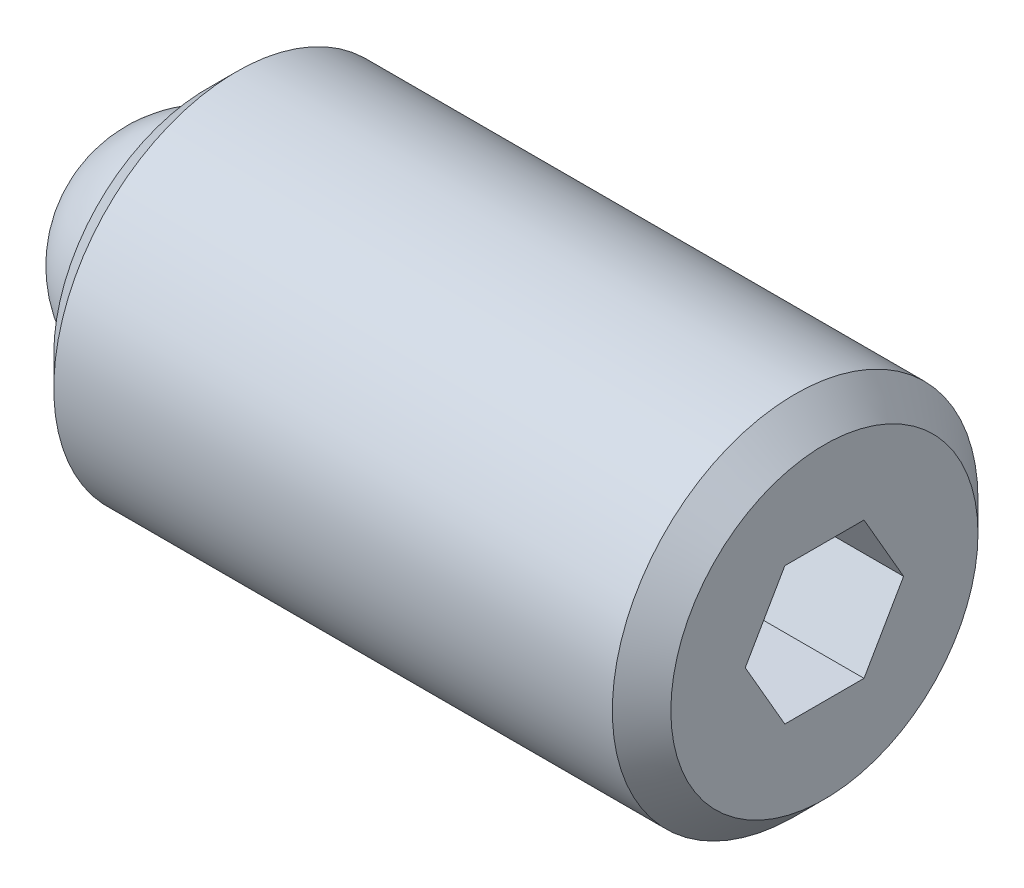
ISO-10303-21;
HEADER;
FILE_DESCRIPTION(('STEP AP214'),'2;1');
FILE_NAME('part.step','',(''),(''),'','','');
FILE_SCHEMA(('AUTOMOTIVE_DESIGN { 1 0 10303 214 1 1 1 1 }'));
ENDSEC;
DATA;
#1=APPLICATION_CONTEXT('core data for automotive mechanical design processes');
#2=APPLICATION_PROTOCOL_DEFINITION('international standard','automotive_design',2000,#1);
#3=PRODUCT_CONTEXT('',#1,'mechanical');
#4=PRODUCT('Part','Part','',(#3));
#5=PRODUCT_RELATED_PRODUCT_CATEGORY('part','',(#4));
#6=PRODUCT_DEFINITION_FORMATION('','',#4);
#7=PRODUCT_DEFINITION_CONTEXT('part definition',#1,'design');
#8=PRODUCT_DEFINITION('design','',#6,#7);
#9=PRODUCT_DEFINITION_SHAPE('','',#8);
#10=(LENGTH_UNIT() NAMED_UNIT(*) SI_UNIT(.MILLI.,.METRE.));
#11=(NAMED_UNIT(*) PLANE_ANGLE_UNIT() SI_UNIT($,.RADIAN.));
#12=(NAMED_UNIT(*) SI_UNIT($,.STERADIAN.) SOLID_ANGLE_UNIT());
#13=UNCERTAINTY_MEASURE_WITH_UNIT(LENGTH_MEASURE(1.E-05),#10,'distance_accuracy_value','');
#14=(GEOMETRIC_REPRESENTATION_CONTEXT(3) GLOBAL_UNCERTAINTY_ASSIGNED_CONTEXT((#13)) GLOBAL_UNIT_ASSIGNED_CONTEXT((#10,
#11,#12)) REPRESENTATION_CONTEXT('',''));
#15=CARTESIAN_POINT('',(0.,0.,0.));
#16=DIRECTION('',(0.,0.,1.));
#17=DIRECTION('',(1.,0.,0.));
#18=AXIS2_PLACEMENT_3D('',#15,#16,#17);
#19=CARTESIAN_POINT('',(0.,0.,0.));
#20=DIRECTION('',(0.,-1.,0.));
#21=DIRECTION('',(0.,0.,1.));
#22=AXIS2_PLACEMENT_3D('',#19,#20,#21);
#23=SPHERICAL_SURFACE('',#22,1.984375);
#24=CARTESIAN_POINT('',(0.,-1.984375,0.));
#25=VERTEX_POINT('',#24);
#26=VERTEX_LOOP('',#25);
#27=FACE_BOUND('',#26,.T.);
#28=ADVANCED_FACE('F43',(#27),#23,.T.);
#29=CLOSED_SHELL('',(#28));
#30=MANIFOLD_SOLID_BREP('B2',#29);
#31=CARTESIAN_POINT('',(10.715625,0.,0.));
#32=DIRECTION('',(-1.,0.,0.));
#33=DIRECTION('',(0.,0.,1.));
#34=AXIS2_PLACEMENT_3D('',#31,#32,#33);
#35=CYLINDRICAL_SURFACE('',#34,3.175);
#36=CARTESIAN_POINT('',(10.207625,0.,0.));
#37=DIRECTION('',(1.,0.,0.));
#38=DIRECTION('',(0.,0.,-1.));
#39=AXIS2_PLACEMENT_3D('',#36,#37,#38);
#40=CIRCLE('',#39,3.175);
#41=CARTESIAN_POINT('',(10.207625,0.,-3.175));
#42=VERTEX_POINT('',#41);
#43=EDGE_CURVE('E41',#42,#42,#40,.F.);
#44=ORIENTED_EDGE('',*,*,#43,.T.);
#45=EDGE_LOOP('',(#44));
#46=FACE_BOUND('',#45,.T.);
#47=CARTESIAN_POINT('',(0.507999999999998,0.,0.));
#48=DIRECTION('',(1.,0.,0.));
#49=DIRECTION('',(0.,0.,-1.));
#50=AXIS2_PLACEMENT_3D('',#47,#48,#49);
#51=CIRCLE('',#50,3.175);
#52=CARTESIAN_POINT('',(0.507999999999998,0.,-3.175));
#53=VERTEX_POINT('',#52);
#54=EDGE_CURVE('E159',#53,#53,#51,.T.);
#55=ORIENTED_EDGE('',*,*,#54,.T.);
#56=EDGE_LOOP('',(#55));
#57=FACE_BOUND('',#56,.T.);
#58=ADVANCED_FACE('F56',(#46,#57),#35,.T.);
#59=CARTESIAN_POINT('',(10.715625,0.,0.));
#60=DIRECTION('',(1.,0.,0.));
#61=DIRECTION('',(0.,0.,-1.));
#62=AXIS2_PLACEMENT_3D('',#59,#60,#61);
#63=PLANE('',#62);
#64=DIRECTION('',(0.,0.866025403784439,-0.5));
#65=VECTOR('',#64,1.);
#66=CARTESIAN_POINT('',(10.715625,-1.190625,-0.687407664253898));
#67=LINE('',#66,#65);
#68=CARTESIAN_POINT('',(10.715625,-1.190625,-0.687407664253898));
#69=VERTEX_POINT('',#68);
#70=CARTESIAN_POINT('',(10.715625,0.,-1.3748153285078));
#71=VERTEX_POINT('',#70);
#72=EDGE_CURVE('E71',#69,#71,#67,.T.);
#73=ORIENTED_EDGE('',*,*,#72,.F.);
#74=DIRECTION('',(0.,0.,-1.));
#75=VECTOR('',#74,1.);
#76=CARTESIAN_POINT('',(10.715625,-1.190625,0.687407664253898));
#77=LINE('',#76,#75);
#78=CARTESIAN_POINT('',(10.715625,-1.190625,0.687407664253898));
#79=VERTEX_POINT('',#78);
#80=EDGE_CURVE('E155',#79,#69,#77,.T.);
#81=ORIENTED_EDGE('',*,*,#80,.F.);
#82=DIRECTION('',(0.,-0.866025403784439,-0.5));
#83=VECTOR('',#82,1.);
#84=CARTESIAN_POINT('',(10.715625,0.,1.3748153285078));
#85=LINE('',#84,#83);
#86=CARTESIAN_POINT('',(10.715625,0.,1.3748153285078));
#87=VERTEX_POINT('',#86);
#88=EDGE_CURVE('E153',#87,#79,#85,.T.);
#89=ORIENTED_EDGE('',*,*,#88,.F.);
#90=DIRECTION('',(0.,-0.866025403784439,0.5));
#91=VECTOR('',#90,1.);
#92=CARTESIAN_POINT('',(10.715625,1.190625,0.687407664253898));
#93=LINE('',#92,#91);
#94=CARTESIAN_POINT('',(10.715625,1.190625,0.687407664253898));
#95=VERTEX_POINT('',#94);
#96=EDGE_CURVE('E119',#95,#87,#93,.T.);
#97=ORIENTED_EDGE('',*,*,#96,.F.);
#98=DIRECTION('',(0.,0.,1.));
#99=VECTOR('',#98,1.);
#100=CARTESIAN_POINT('',(10.715625,1.190625,-0.687407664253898));
#101=LINE('',#100,#99);
#102=CARTESIAN_POINT('',(10.715625,1.190625,-0.687407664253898));
#103=VERTEX_POINT('',#102);
#104=EDGE_CURVE('E149',#103,#95,#101,.T.);
#105=ORIENTED_EDGE('',*,*,#104,.F.);
#106=DIRECTION('',(0.,0.866025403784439,0.5));
#107=VECTOR('',#106,1.);
#108=CARTESIAN_POINT('',(10.715625,0.,-1.3748153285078));
#109=LINE('',#108,#107);
#110=EDGE_CURVE('E145',#71,#103,#109,.T.);
#111=ORIENTED_EDGE('',*,*,#110,.F.);
#112=EDGE_LOOP('',(#73,#81,#89,#97,#105,#111));
#113=FACE_BOUND('',#112,.T.);
#114=CARTESIAN_POINT('',(10.715625,0.,0.));
#115=DIRECTION('',(1.,0.,0.));
#116=DIRECTION('',(0.,0.,-1.));
#117=AXIS2_PLACEMENT_3D('',#114,#115,#116);
#118=CIRCLE('',#117,2.667);
#119=CARTESIAN_POINT('',(10.715625,0.,-2.667));
#120=VERTEX_POINT('',#119);
#121=EDGE_CURVE('E64',#120,#120,#118,.T.);
#122=ORIENTED_EDGE('',*,*,#121,.T.);
#123=EDGE_LOOP('',(#122));
#124=FACE_BOUND('',#123,.T.);
#125=ADVANCED_FACE('F172',(#113,#124),#63,.T.);
#126=CARTESIAN_POINT('',(0.,0.,0.));
#127=DIRECTION('',(1.,0.,0.));
#128=DIRECTION('',(0.,0.,-1.));
#129=AXIS2_PLACEMENT_3D('',#126,#127,#128);
#130=PLANE('',#129);
#131=CARTESIAN_POINT('',(0.,0.,0.));
#132=DIRECTION('',(-1.,0.,0.));
#133=DIRECTION('',(0.,0.,1.));
#134=AXIS2_PLACEMENT_3D('',#131,#132,#133);
#135=CIRCLE('',#134,1.9812);
#136=CARTESIAN_POINT('',(0.,0.,1.9812));
#137=VERTEX_POINT('',#136);
#138=EDGE_CURVE('E227',#137,#137,#135,.T.);
#139=ORIENTED_EDGE('',*,*,#138,.F.);
#140=EDGE_LOOP('',(#139));
#141=FACE_BOUND('',#140,.T.);
#142=CARTESIAN_POINT('',(0.,0.,0.));
#143=DIRECTION('',(1.,0.,0.));
#144=DIRECTION('',(0.,0.,-1.));
#145=AXIS2_PLACEMENT_3D('',#142,#143,#144);
#146=CIRCLE('',#145,2.667);
#147=CARTESIAN_POINT('',(0.,0.,-2.667));
#148=VERTEX_POINT('',#147);
#149=EDGE_CURVE('E167',#148,#148,#146,.F.);
#150=ORIENTED_EDGE('',*,*,#149,.T.);
#151=EDGE_LOOP('',(#150));
#152=FACE_BOUND('',#151,.T.);
#153=ADVANCED_FACE('F184',(#141,#152),#130,.F.);
#154=CARTESIAN_POINT('',(0.507999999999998,0.,0.));
#155=DIRECTION('',(1.,0.,0.));
#156=DIRECTION('',(0.,0.,-1.));
#157=AXIS2_PLACEMENT_3D('',#154,#155,#156);
#158=CONICAL_SURFACE('',#157,3.175,0.785398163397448);
#159=ORIENTED_EDGE('',*,*,#149,.F.);
#160=EDGE_LOOP('',(#159));
#161=FACE_BOUND('',#160,.T.);
#162=ORIENTED_EDGE('',*,*,#54,.F.);
#163=EDGE_LOOP('',(#162));
#164=FACE_BOUND('',#163,.T.);
#165=ADVANCED_FACE('F176',(#161,#164),#158,.T.);
#166=CARTESIAN_POINT('',(10.715625,0.,0.));
#167=DIRECTION('',(-1.,0.,0.));
#168=DIRECTION('',(0.,0.,1.));
#169=AXIS2_PLACEMENT_3D('',#166,#167,#168);
#170=CONICAL_SURFACE('',#169,2.667,0.785398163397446);
#171=ORIENTED_EDGE('',*,*,#43,.F.);
#172=EDGE_LOOP('',(#171));
#173=FACE_BOUND('',#172,.T.);
#174=ORIENTED_EDGE('',*,*,#121,.F.);
#175=EDGE_LOOP('',(#174));
#176=FACE_BOUND('',#175,.T.);
#177=ADVANCED_FACE('F58',(#173,#176),#170,.T.);
#178=CARTESIAN_POINT('',(8.429625,-1.190625,-0.687407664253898));
#179=DIRECTION('',(0.,-0.5,-0.866025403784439));
#180=DIRECTION('',(0.,0.866025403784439,-0.5));
#181=AXIS2_PLACEMENT_3D('',#178,#179,#180);
#182=PLANE('',#181);
#183=ORIENTED_EDGE('',*,*,#72,.T.);
#184=DIRECTION('',(1.,0.,0.));
#185=VECTOR('',#184,1.);
#186=CARTESIAN_POINT('',(8.429625,0.,-1.3748153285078));
#187=LINE('',#186,#185);
#188=CARTESIAN_POINT('',(8.429625,0.,-1.3748153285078));
#189=VERTEX_POINT('',#188);
#190=EDGE_CURVE('E101',#189,#71,#187,.T.);
#191=ORIENTED_EDGE('',*,*,#190,.F.);
#192=DIRECTION('',(0.,0.866025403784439,-0.5));
#193=VECTOR('',#192,1.);
#194=CARTESIAN_POINT('',(8.429625,-1.190625,-0.687407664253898));
#195=LINE('',#194,#193);
#196=CARTESIAN_POINT('',(8.429625,-1.190625,-0.687407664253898));
#197=VERTEX_POINT('',#196);
#198=EDGE_CURVE('E157',#197,#189,#195,.T.);
#199=ORIENTED_EDGE('',*,*,#198,.F.);
#200=DIRECTION('',(1.,0.,0.));
#201=VECTOR('',#200,1.);
#202=CARTESIAN_POINT('',(8.429625,-1.190625,-0.687407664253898));
#203=LINE('',#202,#201);
#204=EDGE_CURVE('E79',#197,#69,#203,.T.);
#205=ORIENTED_EDGE('',*,*,#204,.T.);
#206=EDGE_LOOP('',(#183,#191,#199,#205));
#207=FACE_BOUND('',#206,.T.);
#208=ADVANCED_FACE('F175',(#207),#182,.F.);
#209=CARTESIAN_POINT('',(8.429625,-1.190625,0.687407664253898));
#210=DIRECTION('',(0.,-1.,0.));
#211=DIRECTION('',(0.,0.,-1.));
#212=AXIS2_PLACEMENT_3D('',#209,#210,#211);
#213=PLANE('',#212);
#214=ORIENTED_EDGE('',*,*,#80,.T.);
#215=ORIENTED_EDGE('',*,*,#204,.F.);
#216=DIRECTION('',(0.,0.,-1.));
#217=VECTOR('',#216,1.);
#218=CARTESIAN_POINT('',(8.429625,-1.190625,0.687407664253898));
#219=LINE('',#218,#217);
#220=CARTESIAN_POINT('',(8.429625,-1.190625,0.687407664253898));
#221=VERTEX_POINT('',#220);
#222=EDGE_CURVE('E131',#221,#197,#219,.T.);
#223=ORIENTED_EDGE('',*,*,#222,.F.);
#224=DIRECTION('',(1.,0.,0.));
#225=VECTOR('',#224,1.);
#226=CARTESIAN_POINT('',(8.429625,-1.190625,0.687407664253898));
#227=LINE('',#226,#225);
#228=EDGE_CURVE('E123',#221,#79,#227,.T.);
#229=ORIENTED_EDGE('',*,*,#228,.T.);
#230=EDGE_LOOP('',(#214,#215,#223,#229));
#231=FACE_BOUND('',#230,.T.);
#232=ADVANCED_FACE('F182',(#231),#213,.F.);
#233=CARTESIAN_POINT('',(8.429625,0.,1.3748153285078));
#234=DIRECTION('',(0.,-0.5,0.866025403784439));
#235=DIRECTION('',(0.,-0.866025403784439,-0.5));
#236=AXIS2_PLACEMENT_3D('',#233,#234,#235);
#237=PLANE('',#236);
#238=ORIENTED_EDGE('',*,*,#88,.T.);
#239=ORIENTED_EDGE('',*,*,#228,.F.);
#240=DIRECTION('',(0.,-0.866025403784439,-0.5));
#241=VECTOR('',#240,1.);
#242=CARTESIAN_POINT('',(8.429625,0.,1.3748153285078));
#243=LINE('',#242,#241);
#244=CARTESIAN_POINT('',(8.429625,0.,1.3748153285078));
#245=VERTEX_POINT('',#244);
#246=EDGE_CURVE('E127',#245,#221,#243,.T.);
#247=ORIENTED_EDGE('',*,*,#246,.F.);
#248=DIRECTION('',(1.,0.,0.));
#249=VECTOR('',#248,1.);
#250=CARTESIAN_POINT('',(8.429625,0.,1.3748153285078));
#251=LINE('',#250,#249);
#252=EDGE_CURVE('E112',#245,#87,#251,.T.);
#253=ORIENTED_EDGE('',*,*,#252,.T.);
#254=EDGE_LOOP('',(#238,#239,#247,#253));
#255=FACE_BOUND('',#254,.T.);
#256=ADVANCED_FACE('F128',(#255),#237,.F.);
#257=CARTESIAN_POINT('',(8.429625,1.190625,0.687407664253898));
#258=DIRECTION('',(0.,0.5,0.866025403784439));
#259=DIRECTION('',(0.,-0.866025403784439,0.5));
#260=AXIS2_PLACEMENT_3D('',#257,#258,#259);
#261=PLANE('',#260);
#262=ORIENTED_EDGE('',*,*,#96,.T.);
#263=ORIENTED_EDGE('',*,*,#252,.F.);
#264=DIRECTION('',(0.,-0.866025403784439,0.5));
#265=VECTOR('',#264,1.);
#266=CARTESIAN_POINT('',(8.429625,1.190625,0.687407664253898));
#267=LINE('',#266,#265);
#268=CARTESIAN_POINT('',(8.429625,1.190625,0.687407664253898));
#269=VERTEX_POINT('',#268);
#270=EDGE_CURVE('E116',#269,#245,#267,.T.);
#271=ORIENTED_EDGE('',*,*,#270,.F.);
#272=DIRECTION('',(1.,0.,0.));
#273=VECTOR('',#272,1.);
#274=CARTESIAN_POINT('',(8.429625,1.190625,0.687407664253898));
#275=LINE('',#274,#273);
#276=EDGE_CURVE('E124',#269,#95,#275,.T.);
#277=ORIENTED_EDGE('',*,*,#276,.T.);
#278=EDGE_LOOP('',(#262,#263,#271,#277));
#279=FACE_BOUND('',#278,.T.);
#280=ADVANCED_FACE('F114',(#279),#261,.F.);
#281=CARTESIAN_POINT('',(8.429625,1.190625,-0.687407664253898));
#282=DIRECTION('',(0.,1.,0.));
#283=DIRECTION('',(0.,0.,1.));
#284=AXIS2_PLACEMENT_3D('',#281,#282,#283);
#285=PLANE('',#284);
#286=ORIENTED_EDGE('',*,*,#104,.T.);
#287=ORIENTED_EDGE('',*,*,#276,.F.);
#288=DIRECTION('',(0.,0.,1.));
#289=VECTOR('',#288,1.);
#290=CARTESIAN_POINT('',(8.429625,1.190625,-0.687407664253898));
#291=LINE('',#290,#289);
#292=CARTESIAN_POINT('',(8.429625,1.190625,-0.687407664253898));
#293=VERTEX_POINT('',#292);
#294=EDGE_CURVE('E137',#293,#269,#291,.T.);
#295=ORIENTED_EDGE('',*,*,#294,.F.);
#296=DIRECTION('',(1.,0.,0.));
#297=VECTOR('',#296,1.);
#298=CARTESIAN_POINT('',(8.429625,1.190625,-0.687407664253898));
#299=LINE('',#298,#297);
#300=EDGE_CURVE('E162',#293,#103,#299,.T.);
#301=ORIENTED_EDGE('',*,*,#300,.T.);
#302=EDGE_LOOP('',(#286,#287,#295,#301));
#303=FACE_BOUND('',#302,.T.);
#304=ADVANCED_FACE('F203',(#303),#285,.F.);
#305=CARTESIAN_POINT('',(8.429625,0.,-1.3748153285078));
#306=DIRECTION('',(0.,0.5,-0.866025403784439));
#307=DIRECTION('',(0.,0.866025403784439,0.5));
#308=AXIS2_PLACEMENT_3D('',#305,#306,#307);
#309=PLANE('',#308);
#310=ORIENTED_EDGE('',*,*,#110,.T.);
#311=ORIENTED_EDGE('',*,*,#300,.F.);
#312=DIRECTION('',(0.,0.866025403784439,0.5));
#313=VECTOR('',#312,1.);
#314=CARTESIAN_POINT('',(8.429625,0.,-1.3748153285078));
#315=LINE('',#314,#313);
#316=EDGE_CURVE('E139',#189,#293,#315,.T.);
#317=ORIENTED_EDGE('',*,*,#316,.F.);
#318=ORIENTED_EDGE('',*,*,#190,.T.);
#319=EDGE_LOOP('',(#310,#311,#317,#318));
#320=FACE_BOUND('',#319,.T.);
#321=ADVANCED_FACE('F200',(#320),#309,.F.);
#322=CARTESIAN_POINT('',(8.429625,0.,0.));
#323=DIRECTION('',(1.,0.,0.));
#324=DIRECTION('',(0.,0.,-1.));
#325=AXIS2_PLACEMENT_3D('',#322,#323,#324);
#326=PLANE('',#325);
#327=ORIENTED_EDGE('',*,*,#198,.T.);
#328=ORIENTED_EDGE('',*,*,#316,.T.);
#329=ORIENTED_EDGE('',*,*,#294,.T.);
#330=ORIENTED_EDGE('',*,*,#270,.T.);
#331=ORIENTED_EDGE('',*,*,#246,.T.);
#332=ORIENTED_EDGE('',*,*,#222,.T.);
#333=EDGE_LOOP('',(#327,#328,#329,#330,#331,#332));
#334=FACE_BOUND('',#333,.T.);
#335=ADVANCED_FACE('F134',(#334),#326,.T.);
#336=CARTESIAN_POINT('',(1.984375,0.,0.));
#337=DIRECTION('',(-1.,0.,0.));
#338=DIRECTION('',(0.,0.,1.));
#339=AXIS2_PLACEMENT_3D('',#336,#337,#338);
#340=CYLINDRICAL_SURFACE('',#339,1.9812);
#341=CARTESIAN_POINT('',(1.984375,0.,0.));
#342=DIRECTION('',(-1.,0.,0.));
#343=DIRECTION('',(0.,0.,1.));
#344=AXIS2_PLACEMENT_3D('',#341,#342,#343);
#345=CIRCLE('',#344,1.9812);
#346=CARTESIAN_POINT('',(1.984375,0.,1.9812));
#347=VERTEX_POINT('',#346);
#348=EDGE_CURVE('E146',#347,#347,#345,.T.);
#349=ORIENTED_EDGE('',*,*,#348,.F.);
#350=EDGE_LOOP('',(#349));
#351=FACE_BOUND('',#350,.T.);
#352=ORIENTED_EDGE('',*,*,#138,.T.);
#353=EDGE_LOOP('',(#352));
#354=FACE_BOUND('',#353,.T.);
#355=ADVANCED_FACE('F216',(#351,#354),#340,.F.);
#356=CARTESIAN_POINT('',(1.984375,0.,0.));
#357=DIRECTION('',(-1.,0.,0.));
#358=DIRECTION('',(0.,0.,1.));
#359=AXIS2_PLACEMENT_3D('',#356,#357,#358);
#360=PLANE('',#359);
#361=ORIENTED_EDGE('',*,*,#348,.T.);
#362=EDGE_LOOP('',(#361));
#363=FACE_BOUND('',#362,.T.);
#364=ADVANCED_FACE('F219',(#363),#360,.T.);
#365=CLOSED_SHELL('',(#58,#125,#153,#165,#177,#208,#232,#256,#280,#304,#321,#335,#355,#364));
#366=MANIFOLD_SOLID_BREP('B6',#365);
#367=ADVANCED_BREP_SHAPE_REPRESENTATION('',(#18,#30,#366),#14);
#368=SHAPE_DEFINITION_REPRESENTATION(#9,#367);
ENDSEC;
END-ISO-10303-21;
